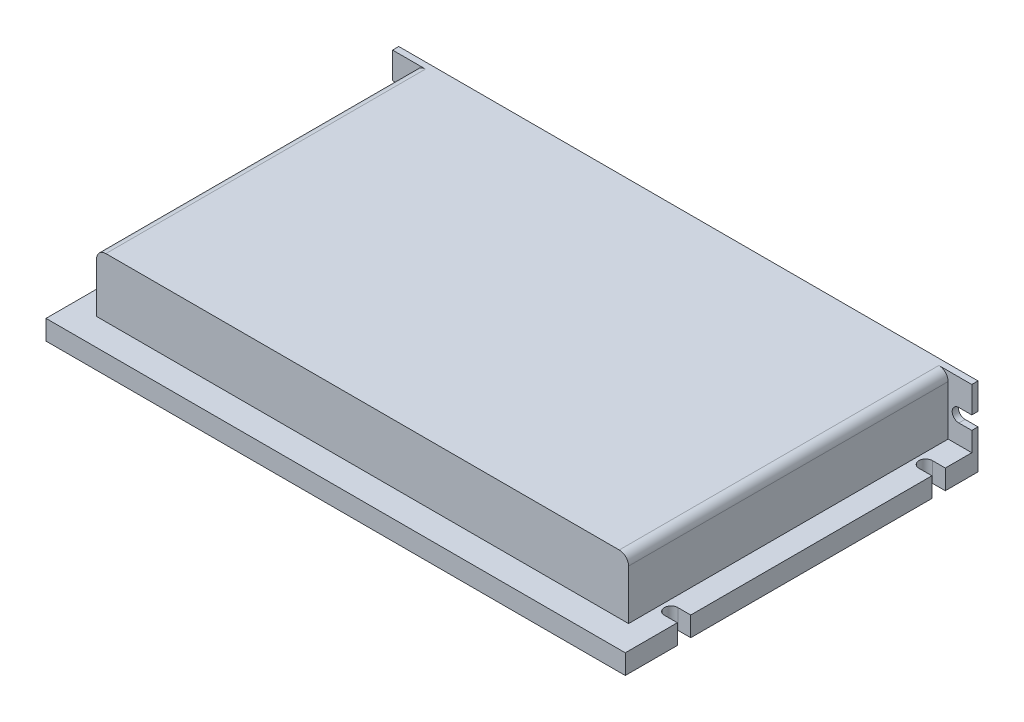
from build123d import *

# Parameters (mm, degrees)
BASE_EXTRUSION_DEPTH    = 2
ESQUISSE2_W             = 186.69
ESQUISSE2_H             = 6.35
BOSS_EXTRU_1_DEPTH      = 111.68
BOSS_EXTRU_2_DEPTH      = 103
ENL_V_MAT_EXTRU_1_DEPTH = 172.278723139


with BuildPart() as part:
    # Esquisse1 → Base-Extrusion (new body)
    with BuildSketch(Plane.XY):
        with BuildLine():
            Line((-60, 10), (126.69, 10))
            Line((126.69, 10), (126.69, 1.485))
            Line((126.69, 1.485), (122.52, 1.485))
            ThreePointArc((122.52, 1.485), (120.365, -0.67), (122.52, -2.825))
            Line((122.52, -2.825), (126.69, -2.825))
            Line((126.69, -2.825), (126.69, -15.4))
            Line((126.69, -15.4), (-60, -15.4))
            Line((-60, -15.4), (-60, -2.825))
            Line((-60, -2.825), (-55.83, -2.825))
            ThreePointArc((-55.83, -2.825), (-53.675, -0.67), (-55.83, 1.485))
            Line((-55.83, 1.485), (-60, 1.485))
            Line((-60, 1.485), (-60, 10))
        make_face()
    extrude(amount=BASE_EXTRUSION_DEPTH)

    # Esquisse2 → Boss.-Extru.1 (add)
    with BuildSketch(Plane.XY.offset(2)):
        with Locations((33.345, -12.225)):
            Rectangle(ESQUISSE2_W, ESQUISSE2_H)
    extrude(amount=BOSS_EXTRU_1_DEPTH)

    # Esquisse3 → Boss.-Extru.2 (add)
    with BuildSketch(Plane.XY.offset(2)):
        with BuildLine():
            Line((-52.38, -9.05), (119.07, -9.05))
            Line((119.07, -9.05), (119.07, 7))
            ThreePointArc((119.07, 7), (118.191320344, 9.121320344), (116.07, 10))
            Line((116.07, 10), (-49.38, 10))
            ThreePointArc((-49.38, 10), (-51.501320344, 9.121320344), (-52.38, 7))
            Line((-52.38, 7), (-52.38, -9.05))
        make_face()
    extrude(amount=BOSS_EXTRU_2_DEPTH)

    # Esquisse4 → Enl_v. mat.-Extru.1 (cut, through all)
    with BuildSketch(Plane(origin=(0, -9.05, 0), x_dir=(-1, 0, 0), z_dir=(0, 1, 0))):
        with BuildLine():
            Line((-122.52, 96.9), (-126.69, 96.9))
            Line((-126.69, 96.9), (-126.69, 92.58))
            Line((-126.69, 92.58), (-122.52, 92.58))
            ThreePointArc((-122.52, 92.58), (-120.36, 94.74), (-122.52, 96.9))
        make_face()
        with BuildLine():
            Line((-122.52, 14.86), (-126.69, 14.86))
            Line((-126.69, 14.86), (-126.69, 10.54))
            Line((-126.69, 10.54), (-122.52, 10.54))
            ThreePointArc((-122.52, 10.54), (-120.36, 12.7), (-122.52, 14.86))
        make_face()
        with BuildLine():
            Line((55.83, 10.54), (60, 10.54))
            Line((60, 10.54), (60, 14.86))
            Line((60, 14.86), (55.83, 14.86))
            ThreePointArc((55.83, 14.86), (53.67, 12.7), (55.83, 10.54))
        make_face()
        with BuildLine():
            Line((55.83, 92.58), (60, 92.58))
            Line((60, 92.58), (60, 96.9))
            Line((60, 96.9), (55.83, 96.9))
            ThreePointArc((55.83, 96.9), (53.67, 94.74), (55.83, 92.58))
        make_face()
    extrude(amount=-ENL_V_MAT_EXTRU_1_DEPTH, mode=Mode.SUBTRACT)


solid = part.part
